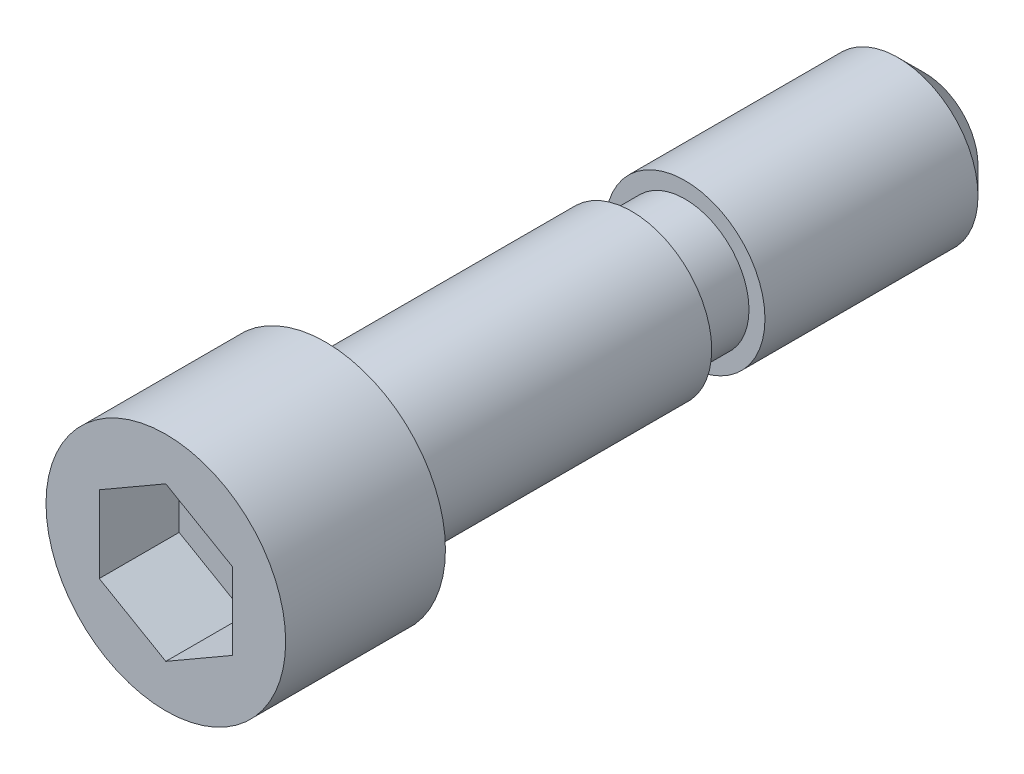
ISO-10303-21;
HEADER;
FILE_DESCRIPTION(('STEP AP214'),'2;1');
FILE_NAME('part.step','',(''),(''),'','','');
FILE_SCHEMA(('AUTOMOTIVE_DESIGN { 1 0 10303 214 1 1 1 1 }'));
ENDSEC;
DATA;
#1=APPLICATION_CONTEXT('core data for automotive mechanical design processes');
#2=APPLICATION_PROTOCOL_DEFINITION('international standard','automotive_design',2000,#1);
#3=PRODUCT_CONTEXT('',#1,'mechanical');
#4=PRODUCT('Part','Part','',(#3));
#5=PRODUCT_RELATED_PRODUCT_CATEGORY('part','',(#4));
#6=PRODUCT_DEFINITION_FORMATION('','',#4);
#7=PRODUCT_DEFINITION_CONTEXT('part definition',#1,'design');
#8=PRODUCT_DEFINITION('design','',#6,#7);
#9=PRODUCT_DEFINITION_SHAPE('','',#8);
#10=(LENGTH_UNIT() NAMED_UNIT(*) SI_UNIT(.MILLI.,.METRE.));
#11=(NAMED_UNIT(*) PLANE_ANGLE_UNIT() SI_UNIT($,.RADIAN.));
#12=(NAMED_UNIT(*) SI_UNIT($,.STERADIAN.) SOLID_ANGLE_UNIT());
#13=UNCERTAINTY_MEASURE_WITH_UNIT(LENGTH_MEASURE(1.E-05),#10,'distance_accuracy_value','');
#14=(GEOMETRIC_REPRESENTATION_CONTEXT(3) GLOBAL_UNCERTAINTY_ASSIGNED_CONTEXT((#13)) GLOBAL_UNIT_ASSIGNED_CONTEXT((#10,
#11,#12)) REPRESENTATION_CONTEXT('',''));
#15=CARTESIAN_POINT('',(0.,0.,0.));
#16=DIRECTION('',(0.,0.,1.));
#17=DIRECTION('',(1.,0.,0.));
#18=AXIS2_PLACEMENT_3D('',#15,#16,#17);
#19=CARTESIAN_POINT('',(-9.,0.,12.));
#20=DIRECTION('',(0.,0.,-1.));
#21=DIRECTION('',(-1.,0.,0.));
#22=AXIS2_PLACEMENT_3D('',#19,#20,#21);
#23=PLANE('',#22);
#24=DIRECTION('',(-0.866025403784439,-0.5,0.));
#25=VECTOR('',#24,1.);
#26=CARTESIAN_POINT('',(0.,5.77350269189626,12.));
#27=LINE('',#26,#25);
#28=CARTESIAN_POINT('',(0.,5.77350269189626,12.));
#29=VERTEX_POINT('',#28);
#30=CARTESIAN_POINT('',(-5.,2.88675134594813,12.));
#31=VERTEX_POINT('',#30);
#32=EDGE_CURVE('E82',#29,#31,#27,.T.);
#33=ORIENTED_EDGE('',*,*,#32,.F.);
#34=DIRECTION('',(-0.866025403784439,0.5,0.));
#35=VECTOR('',#34,1.);
#36=CARTESIAN_POINT('',(5.,2.88675134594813,12.));
#37=LINE('',#36,#35);
#38=CARTESIAN_POINT('',(5.,2.88675134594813,12.));
#39=VERTEX_POINT('',#38);
#40=EDGE_CURVE('E28',#39,#29,#37,.T.);
#41=ORIENTED_EDGE('',*,*,#40,.F.);
#42=DIRECTION('',(0.,1.,0.));
#43=VECTOR('',#42,1.);
#44=CARTESIAN_POINT('',(5.,-2.88675134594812,12.));
#45=LINE('',#44,#43);
#46=CARTESIAN_POINT('',(5.,-2.88675134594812,12.));
#47=VERTEX_POINT('',#46);
#48=EDGE_CURVE('E97',#47,#39,#45,.T.);
#49=ORIENTED_EDGE('',*,*,#48,.F.);
#50=DIRECTION('',(0.866025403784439,0.5,0.));
#51=VECTOR('',#50,1.);
#52=CARTESIAN_POINT('',(0.,-5.77350269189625,12.));
#53=LINE('',#52,#51);
#54=CARTESIAN_POINT('',(0.,-5.77350269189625,12.));
#55=VERTEX_POINT('',#54);
#56=EDGE_CURVE('E91',#55,#47,#53,.T.);
#57=ORIENTED_EDGE('',*,*,#56,.F.);
#58=DIRECTION('',(0.866025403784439,-0.5,0.));
#59=VECTOR('',#58,1.);
#60=CARTESIAN_POINT('',(-5.,-2.88675134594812,12.));
#61=LINE('',#60,#59);
#62=CARTESIAN_POINT('',(-5.,-2.88675134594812,12.));
#63=VERTEX_POINT('',#62);
#64=EDGE_CURVE('E89',#63,#55,#61,.T.);
#65=ORIENTED_EDGE('',*,*,#64,.F.);
#66=DIRECTION('',(0.,-1.,0.));
#67=VECTOR('',#66,1.);
#68=CARTESIAN_POINT('',(-5.,2.88675134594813,12.));
#69=LINE('',#68,#67);
#70=EDGE_CURVE('E71',#31,#63,#69,.T.);
#71=ORIENTED_EDGE('',*,*,#70,.F.);
#72=EDGE_LOOP('',(#33,#41,#49,#57,#65,#71));
#73=FACE_BOUND('',#72,.T.);
#74=CARTESIAN_POINT('',(0.,0.,12.));
#75=DIRECTION('',(0.,0.,1.));
#76=DIRECTION('',(1.,0.,0.));
#77=AXIS2_PLACEMENT_3D('',#74,#75,#76);
#78=CIRCLE('',#77,9.);
#79=CARTESIAN_POINT('',(9.,0.,12.));
#80=VERTEX_POINT('',#79);
#81=EDGE_CURVE('E9',#80,#80,#78,.T.);
#82=ORIENTED_EDGE('',*,*,#81,.T.);
#83=EDGE_LOOP('',(#82));
#84=FACE_BOUND('',#83,.T.);
#85=ADVANCED_FACE('F14',(#73,#84),#23,.F.);
#86=CARTESIAN_POINT('',(0.,0.,35.));
#87=DIRECTION('',(0.,0.,1.));
#88=DIRECTION('',(1.,0.,0.));
#89=AXIS2_PLACEMENT_3D('',#86,#87,#88);
#90=CYLINDRICAL_SURFACE('',#89,9.);
#91=ORIENTED_EDGE('',*,*,#81,.F.);
#92=EDGE_LOOP('',(#91));
#93=FACE_BOUND('',#92,.T.);
#94=CARTESIAN_POINT('',(0.,0.,0.));
#95=DIRECTION('',(0.,0.,1.));
#96=DIRECTION('',(1.,0.,0.));
#97=AXIS2_PLACEMENT_3D('',#94,#95,#96);
#98=CIRCLE('',#97,9.);
#99=CARTESIAN_POINT('',(9.,0.,0.));
#100=VERTEX_POINT('',#99);
#101=EDGE_CURVE('E21',#100,#100,#98,.T.);
#102=ORIENTED_EDGE('',*,*,#101,.T.);
#103=EDGE_LOOP('',(#102));
#104=FACE_BOUND('',#103,.T.);
#105=ADVANCED_FACE('F144',(#93,#104),#90,.T.);
#106=CARTESIAN_POINT('',(-6.,0.,0.));
#107=DIRECTION('',(0.,0.,1.));
#108=DIRECTION('',(1.,0.,0.));
#109=AXIS2_PLACEMENT_3D('',#106,#107,#108);
#110=PLANE('',#109);
#111=ORIENTED_EDGE('',*,*,#101,.F.);
#112=EDGE_LOOP('',(#111));
#113=FACE_BOUND('',#112,.T.);
#114=CARTESIAN_POINT('',(0.,0.,0.));
#115=DIRECTION('',(0.,0.,1.));
#116=DIRECTION('',(1.,0.,0.));
#117=AXIS2_PLACEMENT_3D('',#114,#115,#116);
#118=CIRCLE('',#117,6.);
#119=CARTESIAN_POINT('',(6.,0.,0.));
#120=VERTEX_POINT('',#119);
#121=EDGE_CURVE('E139',#120,#120,#118,.T.);
#122=ORIENTED_EDGE('',*,*,#121,.T.);
#123=EDGE_LOOP('',(#122));
#124=FACE_BOUND('',#123,.T.);
#125=ADVANCED_FACE('F146',(#113,#124),#110,.F.);
#126=CARTESIAN_POINT('',(0.,0.,35.));
#127=DIRECTION('',(0.,0.,1.));
#128=DIRECTION('',(1.,0.,0.));
#129=AXIS2_PLACEMENT_3D('',#126,#127,#128);
#130=CYLINDRICAL_SURFACE('',#129,6.);
#131=ORIENTED_EDGE('',*,*,#121,.F.);
#132=EDGE_LOOP('',(#131));
#133=FACE_BOUND('',#132,.T.);
#134=CARTESIAN_POINT('',(0.,0.,-23.));
#135=DIRECTION('',(0.,0.,1.));
#136=DIRECTION('',(1.,0.,0.));
#137=AXIS2_PLACEMENT_3D('',#134,#135,#136);
#138=CIRCLE('',#137,6.);
#139=CARTESIAN_POINT('',(6.,0.,-23.));
#140=VERTEX_POINT('',#139);
#141=EDGE_CURVE('E136',#140,#140,#138,.T.);
#142=ORIENTED_EDGE('',*,*,#141,.T.);
#143=EDGE_LOOP('',(#142));
#144=FACE_BOUND('',#143,.T.);
#145=ADVANCED_FACE('F149',(#133,#144),#130,.T.);
#146=CARTESIAN_POINT('',(-4.8,0.,-23.));
#147=DIRECTION('',(0.,0.,1.));
#148=DIRECTION('',(1.,0.,0.));
#149=AXIS2_PLACEMENT_3D('',#146,#147,#148);
#150=PLANE('',#149);
#151=ORIENTED_EDGE('',*,*,#141,.F.);
#152=EDGE_LOOP('',(#151));
#153=FACE_BOUND('',#152,.T.);
#154=CARTESIAN_POINT('',(0.,0.,-23.));
#155=DIRECTION('',(0.,0.,1.));
#156=DIRECTION('',(1.,0.,0.));
#157=AXIS2_PLACEMENT_3D('',#154,#155,#156);
#158=CIRCLE('',#157,4.8);
#159=CARTESIAN_POINT('',(4.8,0.,-23.));
#160=VERTEX_POINT('',#159);
#161=EDGE_CURVE('E133',#160,#160,#158,.T.);
#162=ORIENTED_EDGE('',*,*,#161,.T.);
#163=EDGE_LOOP('',(#162));
#164=FACE_BOUND('',#163,.T.);
#165=ADVANCED_FACE('F155',(#153,#164),#150,.F.);
#166=CARTESIAN_POINT('',(0.,0.,35.));
#167=DIRECTION('',(0.,0.,1.));
#168=DIRECTION('',(1.,0.,0.));
#169=AXIS2_PLACEMENT_3D('',#166,#167,#168);
#170=CYLINDRICAL_SURFACE('',#169,4.8);
#171=ORIENTED_EDGE('',*,*,#161,.F.);
#172=EDGE_LOOP('',(#171));
#173=FACE_BOUND('',#172,.T.);
#174=CARTESIAN_POINT('',(0.,0.,-27.));
#175=DIRECTION('',(0.,0.,1.));
#176=DIRECTION('',(1.,0.,0.));
#177=AXIS2_PLACEMENT_3D('',#174,#175,#176);
#178=CIRCLE('',#177,4.8);
#179=CARTESIAN_POINT('',(4.8,0.,-27.));
#180=VERTEX_POINT('',#179);
#181=EDGE_CURVE('E130',#180,#180,#178,.T.);
#182=ORIENTED_EDGE('',*,*,#181,.T.);
#183=EDGE_LOOP('',(#182));
#184=FACE_BOUND('',#183,.T.);
#185=ADVANCED_FACE('F161',(#173,#184),#170,.T.);
#186=CARTESIAN_POINT('',(-6.,0.,-27.));
#187=DIRECTION('',(0.,0.,-1.));
#188=DIRECTION('',(-1.,0.,0.));
#189=AXIS2_PLACEMENT_3D('',#186,#187,#188);
#190=PLANE('',#189);
#191=ORIENTED_EDGE('',*,*,#181,.F.);
#192=EDGE_LOOP('',(#191));
#193=FACE_BOUND('',#192,.T.);
#194=CARTESIAN_POINT('',(0.,0.,-27.));
#195=DIRECTION('',(0.,0.,1.));
#196=DIRECTION('',(1.,0.,0.));
#197=AXIS2_PLACEMENT_3D('',#194,#195,#196);
#198=CIRCLE('',#197,6.);
#199=CARTESIAN_POINT('',(6.,0.,-27.));
#200=VERTEX_POINT('',#199);
#201=EDGE_CURVE('E127',#200,#200,#198,.T.);
#202=ORIENTED_EDGE('',*,*,#201,.T.);
#203=EDGE_LOOP('',(#202));
#204=FACE_BOUND('',#203,.T.);
#205=ADVANCED_FACE('F167',(#193,#204),#190,.F.);
#206=CARTESIAN_POINT('',(0.,0.,35.));
#207=DIRECTION('',(0.,0.,1.));
#208=DIRECTION('',(1.,0.,0.));
#209=AXIS2_PLACEMENT_3D('',#206,#207,#208);
#210=CYLINDRICAL_SURFACE('',#209,6.);
#211=ORIENTED_EDGE('',*,*,#201,.F.);
#212=EDGE_LOOP('',(#211));
#213=FACE_BOUND('',#212,.T.);
#214=CARTESIAN_POINT('',(0.,0.,-43.));
#215=DIRECTION('',(0.,0.,1.));
#216=DIRECTION('',(1.,0.,0.));
#217=AXIS2_PLACEMENT_3D('',#214,#215,#216);
#218=CIRCLE('',#217,6.);
#219=CARTESIAN_POINT('',(6.,0.,-43.));
#220=VERTEX_POINT('',#219);
#221=EDGE_CURVE('E124',#220,#220,#218,.T.);
#222=ORIENTED_EDGE('',*,*,#221,.T.);
#223=EDGE_LOOP('',(#222));
#224=FACE_BOUND('',#223,.T.);
#225=ADVANCED_FACE('F173',(#213,#224),#210,.T.);
#226=CARTESIAN_POINT('',(0.,0.,-45.));
#227=DIRECTION('',(0.,0.,1.));
#228=DIRECTION('',(1.,0.,0.));
#229=AXIS2_PLACEMENT_3D('',#226,#227,#228);
#230=CONICAL_SURFACE('',#229,4.,0.785398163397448);
#231=ORIENTED_EDGE('',*,*,#221,.F.);
#232=EDGE_LOOP('',(#231));
#233=FACE_BOUND('',#232,.T.);
#234=CARTESIAN_POINT('',(0.,0.,-45.));
#235=DIRECTION('',(0.,0.,1.));
#236=DIRECTION('',(1.,0.,0.));
#237=AXIS2_PLACEMENT_3D('',#234,#235,#236);
#238=CIRCLE('',#237,4.);
#239=CARTESIAN_POINT('',(4.,0.,-45.));
#240=VERTEX_POINT('',#239);
#241=EDGE_CURVE('E115',#240,#240,#238,.T.);
#242=ORIENTED_EDGE('',*,*,#241,.T.);
#243=EDGE_LOOP('',(#242));
#244=FACE_BOUND('',#243,.T.);
#245=ADVANCED_FACE('F179',(#233,#244),#230,.T.);
#246=CARTESIAN_POINT('',(0.,0.,-45.));
#247=DIRECTION('',(0.,0.,1.));
#248=DIRECTION('',(1.,0.,0.));
#249=AXIS2_PLACEMENT_3D('',#246,#247,#248);
#250=PLANE('',#249);
#251=ORIENTED_EDGE('',*,*,#241,.F.);
#252=EDGE_LOOP('',(#251));
#253=FACE_BOUND('',#252,.T.);
#254=ADVANCED_FACE('F185',(#253),#250,.F.);
#255=CARTESIAN_POINT('',(5.,2.88675134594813,6.));
#256=DIRECTION('',(0.5,0.866025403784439,0.));
#257=DIRECTION('',(-0.866025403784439,0.5,0.));
#258=AXIS2_PLACEMENT_3D('',#255,#256,#257);
#259=PLANE('',#258);
#260=ORIENTED_EDGE('',*,*,#40,.T.);
#261=DIRECTION('',(0.,0.,1.));
#262=VECTOR('',#261,1.);
#263=CARTESIAN_POINT('',(0.,5.77350269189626,6.));
#264=LINE('',#263,#262);
#265=CARTESIAN_POINT('',(0.,5.77350269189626,6.));
#266=VERTEX_POINT('',#265);
#267=EDGE_CURVE('E79',#266,#29,#264,.T.);
#268=ORIENTED_EDGE('',*,*,#267,.F.);
#269=DIRECTION('',(-0.866025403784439,0.5,0.));
#270=VECTOR('',#269,1.);
#271=CARTESIAN_POINT('',(5.,2.88675134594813,6.));
#272=LINE('',#271,#270);
#273=CARTESIAN_POINT('',(5.,2.88675134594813,6.));
#274=VERTEX_POINT('',#273);
#275=EDGE_CURVE('E99',#274,#266,#272,.T.);
#276=ORIENTED_EDGE('',*,*,#275,.F.);
#277=DIRECTION('',(0.,0.,1.));
#278=VECTOR('',#277,1.);
#279=CARTESIAN_POINT('',(5.,2.88675134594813,6.));
#280=LINE('',#279,#278);
#281=EDGE_CURVE('E35',#274,#39,#280,.T.);
#282=ORIENTED_EDGE('',*,*,#281,.T.);
#283=EDGE_LOOP('',(#260,#268,#276,#282));
#284=FACE_BOUND('',#283,.T.);
#285=ADVANCED_FACE('F190',(#284),#259,.F.);
#286=CARTESIAN_POINT('',(5.,-2.88675134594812,6.));
#287=DIRECTION('',(1.,0.,0.));
#288=DIRECTION('',(0.,0.,-1.));
#289=AXIS2_PLACEMENT_3D('',#286,#287,#288);
#290=PLANE('',#289);
#291=ORIENTED_EDGE('',*,*,#48,.T.);
#292=ORIENTED_EDGE('',*,*,#281,.F.);
#293=DIRECTION('',(0.,1.,0.));
#294=VECTOR('',#293,1.);
#295=CARTESIAN_POINT('',(5.,-2.88675134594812,6.));
#296=LINE('',#295,#294);
#297=CARTESIAN_POINT('',(5.,-2.88675134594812,6.));
#298=VERTEX_POINT('',#297);
#299=EDGE_CURVE('E111',#298,#274,#296,.T.);
#300=ORIENTED_EDGE('',*,*,#299,.F.);
#301=DIRECTION('',(0.,0.,1.));
#302=VECTOR('',#301,1.);
#303=CARTESIAN_POINT('',(5.,-2.88675134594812,6.));
#304=LINE('',#303,#302);
#305=EDGE_CURVE('E116',#298,#47,#304,.T.);
#306=ORIENTED_EDGE('',*,*,#305,.T.);
#307=EDGE_LOOP('',(#291,#292,#300,#306));
#308=FACE_BOUND('',#307,.T.);
#309=ADVANCED_FACE('F196',(#308),#290,.F.);
#310=CARTESIAN_POINT('',(0.,-5.77350269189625,6.));
#311=DIRECTION('',(0.5,-0.866025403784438,0.));
#312=DIRECTION('',(0.866025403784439,0.5,0.));
#313=AXIS2_PLACEMENT_3D('',#310,#311,#312);
#314=PLANE('',#313);
#315=ORIENTED_EDGE('',*,*,#56,.T.);
#316=ORIENTED_EDGE('',*,*,#305,.F.);
#317=DIRECTION('',(0.866025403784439,0.5,0.));
#318=VECTOR('',#317,1.);
#319=CARTESIAN_POINT('',(0.,-5.77350269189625,6.));
#320=LINE('',#319,#318);
#321=CARTESIAN_POINT('',(0.,-5.77350269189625,6.));
#322=VERTEX_POINT('',#321);
#323=EDGE_CURVE('E108',#322,#298,#320,.T.);
#324=ORIENTED_EDGE('',*,*,#323,.F.);
#325=DIRECTION('',(0.,0.,1.));
#326=VECTOR('',#325,1.);
#327=CARTESIAN_POINT('',(0.,-5.77350269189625,6.));
#328=LINE('',#327,#326);
#329=EDGE_CURVE('E118',#322,#55,#328,.T.);
#330=ORIENTED_EDGE('',*,*,#329,.T.);
#331=EDGE_LOOP('',(#315,#316,#324,#330));
#332=FACE_BOUND('',#331,.T.);
#333=ADVANCED_FACE('F267',(#332),#314,.F.);
#334=CARTESIAN_POINT('',(-5.,-2.88675134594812,6.));
#335=DIRECTION('',(-0.5,-0.866025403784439,0.));
#336=DIRECTION('',(0.866025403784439,-0.5,0.));
#337=AXIS2_PLACEMENT_3D('',#334,#335,#336);
#338=PLANE('',#337);
#339=ORIENTED_EDGE('',*,*,#64,.T.);
#340=ORIENTED_EDGE('',*,*,#329,.F.);
#341=DIRECTION('',(0.866025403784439,-0.5,0.));
#342=VECTOR('',#341,1.);
#343=CARTESIAN_POINT('',(-5.,-2.88675134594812,6.));
#344=LINE('',#343,#342);
#345=CARTESIAN_POINT('',(-5.,-2.88675134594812,6.));
#346=VERTEX_POINT('',#345);
#347=EDGE_CURVE('E105',#346,#322,#344,.T.);
#348=ORIENTED_EDGE('',*,*,#347,.F.);
#349=DIRECTION('',(0.,0.,1.));
#350=VECTOR('',#349,1.);
#351=CARTESIAN_POINT('',(-5.,-2.88675134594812,6.));
#352=LINE('',#351,#350);
#353=EDGE_CURVE('E78',#346,#63,#352,.T.);
#354=ORIENTED_EDGE('',*,*,#353,.T.);
#355=EDGE_LOOP('',(#339,#340,#348,#354));
#356=FACE_BOUND('',#355,.T.);
#357=ADVANCED_FACE('F276',(#356),#338,.F.);
#358=CARTESIAN_POINT('',(-5.,2.88675134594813,6.));
#359=DIRECTION('',(-1.,0.,0.));
#360=DIRECTION('',(0.,0.,1.));
#361=AXIS2_PLACEMENT_3D('',#358,#359,#360);
#362=PLANE('',#361);
#363=ORIENTED_EDGE('',*,*,#70,.T.);
#364=ORIENTED_EDGE('',*,*,#353,.F.);
#365=DIRECTION('',(0.,-1.,0.));
#366=VECTOR('',#365,1.);
#367=CARTESIAN_POINT('',(-5.,2.88675134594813,6.));
#368=LINE('',#367,#366);
#369=CARTESIAN_POINT('',(-5.,2.88675134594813,6.));
#370=VERTEX_POINT('',#369);
#371=EDGE_CURVE('E74',#370,#346,#368,.T.);
#372=ORIENTED_EDGE('',*,*,#371,.F.);
#373=DIRECTION('',(0.,0.,1.));
#374=VECTOR('',#373,1.);
#375=CARTESIAN_POINT('',(-5.,2.88675134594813,6.));
#376=LINE('',#375,#374);
#377=EDGE_CURVE('E67',#370,#31,#376,.T.);
#378=ORIENTED_EDGE('',*,*,#377,.T.);
#379=EDGE_LOOP('',(#363,#364,#372,#378));
#380=FACE_BOUND('',#379,.T.);
#381=ADVANCED_FACE('F69',(#380),#362,.F.);
#382=CARTESIAN_POINT('',(0.,5.77350269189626,6.));
#383=DIRECTION('',(-0.5,0.866025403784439,0.));
#384=DIRECTION('',(-0.866025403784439,-0.5,0.));
#385=AXIS2_PLACEMENT_3D('',#382,#383,#384);
#386=PLANE('',#385);
#387=ORIENTED_EDGE('',*,*,#32,.T.);
#388=ORIENTED_EDGE('',*,*,#377,.F.);
#389=DIRECTION('',(-0.866025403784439,-0.5,0.));
#390=VECTOR('',#389,1.);
#391=CARTESIAN_POINT('',(0.,5.77350269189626,6.));
#392=LINE('',#391,#390);
#393=EDGE_CURVE('E102',#266,#370,#392,.T.);
#394=ORIENTED_EDGE('',*,*,#393,.F.);
#395=ORIENTED_EDGE('',*,*,#267,.T.);
#396=EDGE_LOOP('',(#387,#388,#394,#395));
#397=FACE_BOUND('',#396,.T.);
#398=ADVANCED_FACE('F83',(#397),#386,.F.);
#399=CARTESIAN_POINT('',(5.,2.88675134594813,6.));
#400=DIRECTION('',(0.,0.,-1.));
#401=DIRECTION('',(-1.,0.,0.));
#402=AXIS2_PLACEMENT_3D('',#399,#400,#401);
#403=PLANE('',#402);
#404=ORIENTED_EDGE('',*,*,#275,.T.);
#405=ORIENTED_EDGE('',*,*,#393,.T.);
#406=ORIENTED_EDGE('',*,*,#371,.T.);
#407=ORIENTED_EDGE('',*,*,#347,.T.);
#408=ORIENTED_EDGE('',*,*,#323,.T.);
#409=ORIENTED_EDGE('',*,*,#299,.T.);
#410=EDGE_LOOP('',(#404,#405,#406,#407,#408,#409));
#411=FACE_BOUND('',#410,.T.);
#412=ADVANCED_FACE('F303',(#411),#403,.F.);
#413=CLOSED_SHELL('',(#85,#105,#125,#145,#165,#185,#205,#225,#245,#254,#285,#309,#333,#357,#381,
#398,#412));
#414=MANIFOLD_SOLID_BREP('B1',#413);
#415=ADVANCED_BREP_SHAPE_REPRESENTATION('',(#18,#414),#14);
#416=SHAPE_DEFINITION_REPRESENTATION(#9,#415);
ENDSEC;
END-ISO-10303-21;
